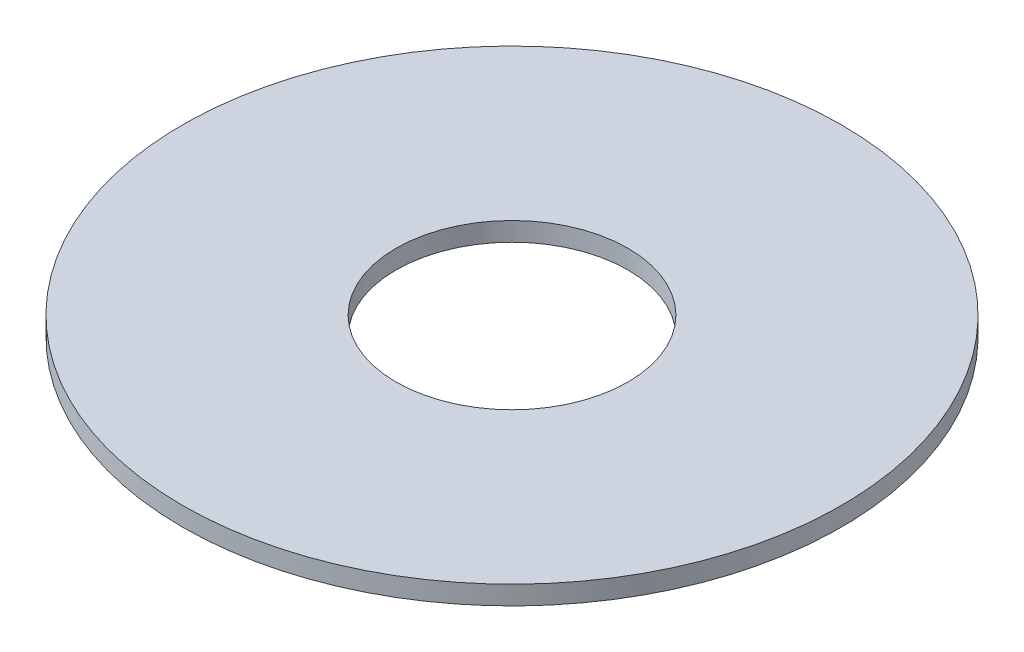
ISO-10303-21;
HEADER;
FILE_DESCRIPTION(('STEP AP214'),'2;1');
FILE_NAME('part.step','',(''),(''),'','','');
FILE_SCHEMA(('AUTOMOTIVE_DESIGN { 1 0 10303 214 1 1 1 1 }'));
ENDSEC;
DATA;
#1=APPLICATION_CONTEXT('core data for automotive mechanical design processes');
#2=APPLICATION_PROTOCOL_DEFINITION('international standard','automotive_design',2000,#1);
#3=PRODUCT_CONTEXT('',#1,'mechanical');
#4=PRODUCT('Part','Part','',(#3));
#5=PRODUCT_RELATED_PRODUCT_CATEGORY('part','',(#4));
#6=PRODUCT_DEFINITION_FORMATION('','',#4);
#7=PRODUCT_DEFINITION_CONTEXT('part definition',#1,'design');
#8=PRODUCT_DEFINITION('design','',#6,#7);
#9=PRODUCT_DEFINITION_SHAPE('','',#8);
#10=(LENGTH_UNIT() NAMED_UNIT(*) SI_UNIT(.MILLI.,.METRE.));
#11=(NAMED_UNIT(*) PLANE_ANGLE_UNIT() SI_UNIT($,.RADIAN.));
#12=(NAMED_UNIT(*) SI_UNIT($,.STERADIAN.) SOLID_ANGLE_UNIT());
#13=UNCERTAINTY_MEASURE_WITH_UNIT(LENGTH_MEASURE(1.E-05),#10,'distance_accuracy_value','');
#14=(GEOMETRIC_REPRESENTATION_CONTEXT(3) GLOBAL_UNCERTAINTY_ASSIGNED_CONTEXT((#13)) GLOBAL_UNIT_ASSIGNED_CONTEXT((#10,
#11,#12)) REPRESENTATION_CONTEXT('',''));
#15=CARTESIAN_POINT('',(0.,0.,0.));
#16=DIRECTION('',(0.,0.,1.));
#17=DIRECTION('',(1.,0.,0.));
#18=AXIS2_PLACEMENT_3D('',#15,#16,#17);
#19=CARTESIAN_POINT('',(0.,0.406400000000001,0.));
#20=DIRECTION('',(0.,-1.,0.));
#21=DIRECTION('',(0.,0.,-0.999999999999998));
#22=AXIS2_PLACEMENT_3D('',#19,#20,#21);
#23=CYLINDRICAL_SURFACE('',#22,7.112);
#24=CARTESIAN_POINT('',(0.,0.406400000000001,0.));
#25=DIRECTION('',(0.,1.,0.));
#26=DIRECTION('',(0.,0.,0.999999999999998));
#27=AXIS2_PLACEMENT_3D('',#24,#25,#26);
#28=CIRCLE('',#27,7.112);
#29=CARTESIAN_POINT('',(0.,0.406400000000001,7.11199999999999));
#30=VERTEX_POINT('',#29);
#31=EDGE_CURVE('E10',#30,#30,#28,.T.);
#32=ORIENTED_EDGE('',*,*,#31,.F.);
#33=EDGE_LOOP('',(#32));
#34=FACE_BOUND('',#33,.T.);
#35=CARTESIAN_POINT('',(0.,0.,0.));
#36=DIRECTION('',(0.,1.,0.));
#37=DIRECTION('',(0.,0.,0.999999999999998));
#38=AXIS2_PLACEMENT_3D('',#35,#36,#37);
#39=CIRCLE('',#38,7.112);
#40=CARTESIAN_POINT('',(0.,0.,7.11199999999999));
#41=VERTEX_POINT('',#40);
#42=EDGE_CURVE('E34',#41,#41,#39,.T.);
#43=ORIENTED_EDGE('',*,*,#42,.T.);
#44=EDGE_LOOP('',(#43));
#45=FACE_BOUND('',#44,.T.);
#46=ADVANCED_FACE('F28',(#34,#45),#23,.T.);
#47=CARTESIAN_POINT('',(0.,0.406400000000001,0.));
#48=DIRECTION('',(0.,1.,0.));
#49=DIRECTION('',(0.,0.,0.999999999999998));
#50=AXIS2_PLACEMENT_3D('',#47,#48,#49);
#51=PLANE('',#50);
#52=CARTESIAN_POINT('',(0.,0.406400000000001,0.));
#53=DIRECTION('',(0.,-1.,0.));
#54=DIRECTION('',(0.,0.,-0.999999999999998));
#55=AXIS2_PLACEMENT_3D('',#52,#53,#54);
#56=CIRCLE('',#55,2.5019);
#57=CARTESIAN_POINT('',(0.,0.406400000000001,-2.5019));
#58=VERTEX_POINT('',#57);
#59=EDGE_CURVE('E38',#58,#58,#56,.T.);
#60=ORIENTED_EDGE('',*,*,#59,.T.);
#61=EDGE_LOOP('',(#60));
#62=FACE_BOUND('',#61,.T.);
#63=ORIENTED_EDGE('',*,*,#31,.T.);
#64=EDGE_LOOP('',(#63));
#65=FACE_BOUND('',#64,.T.);
#66=ADVANCED_FACE('F53',(#62,#65),#51,.T.);
#67=CARTESIAN_POINT('',(0.,0.,0.));
#68=DIRECTION('',(0.,1.,0.));
#69=DIRECTION('',(0.,0.,0.999999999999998));
#70=AXIS2_PLACEMENT_3D('',#67,#68,#69);
#71=PLANE('',#70);
#72=CARTESIAN_POINT('',(0.,0.,0.));
#73=DIRECTION('',(0.,-1.,0.));
#74=DIRECTION('',(0.,0.,-0.999999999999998));
#75=AXIS2_PLACEMENT_3D('',#72,#73,#74);
#76=CIRCLE('',#75,2.5019);
#77=CARTESIAN_POINT('',(0.,0.,-2.5019));
#78=VERTEX_POINT('',#77);
#79=EDGE_CURVE('E42',#78,#78,#76,.T.);
#80=ORIENTED_EDGE('',*,*,#79,.F.);
#81=EDGE_LOOP('',(#80));
#82=FACE_BOUND('',#81,.T.);
#83=ORIENTED_EDGE('',*,*,#42,.F.);
#84=EDGE_LOOP('',(#83));
#85=FACE_BOUND('',#84,.T.);
#86=ADVANCED_FACE('F50',(#82,#85),#71,.F.);
#87=CARTESIAN_POINT('',(0.,0.406400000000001,0.));
#88=DIRECTION('',(0.,-1.,0.));
#89=DIRECTION('',(0.,0.,-0.999999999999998));
#90=AXIS2_PLACEMENT_3D('',#87,#88,#89);
#91=CYLINDRICAL_SURFACE('',#90,2.5019);
#92=ORIENTED_EDGE('',*,*,#59,.F.);
#93=EDGE_LOOP('',(#92));
#94=FACE_BOUND('',#93,.T.);
#95=ORIENTED_EDGE('',*,*,#79,.T.);
#96=EDGE_LOOP('',(#95));
#97=FACE_BOUND('',#96,.T.);
#98=ADVANCED_FACE('F48',(#94,#97),#91,.F.);
#99=CLOSED_SHELL('',(#46,#66,#86,#98));
#100=MANIFOLD_SOLID_BREP('B2',#99);
#101=ADVANCED_BREP_SHAPE_REPRESENTATION('',(#18,#100),#14);
#102=SHAPE_DEFINITION_REPRESENTATION(#9,#101);
ENDSEC;
END-ISO-10303-21;
